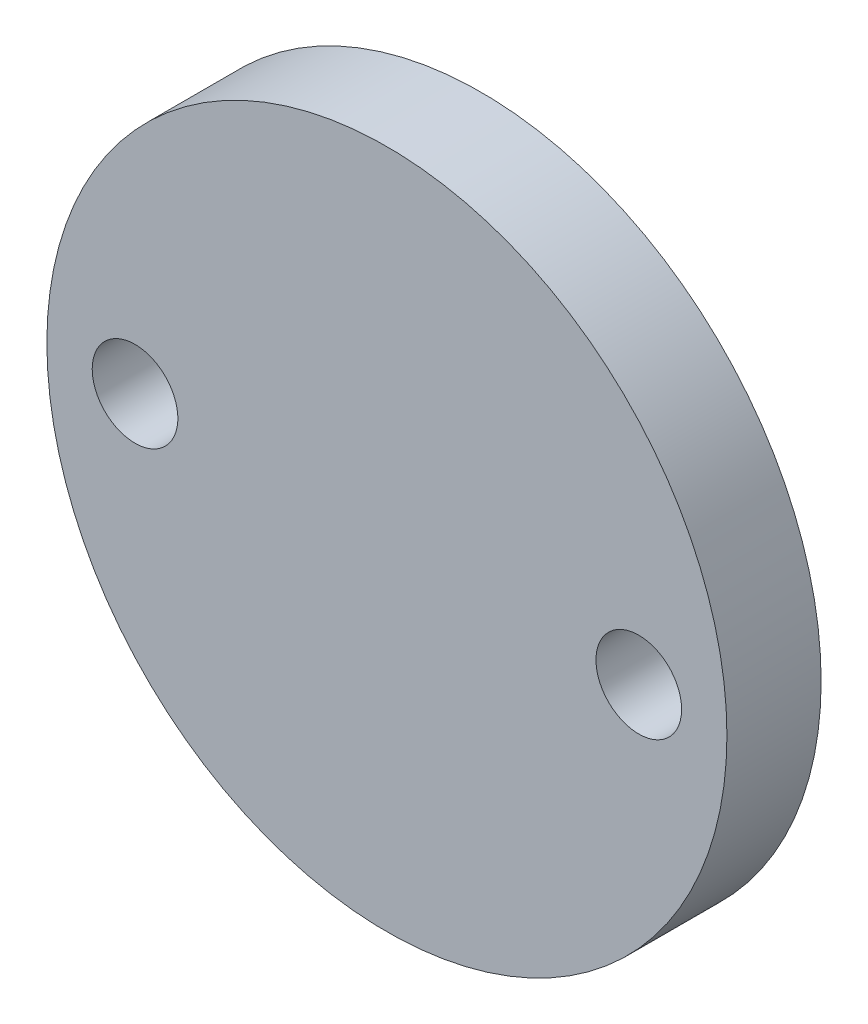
from build123d import *

# Parameters (mm, degrees)
SKETCH1_R          = 17.145
BASE_EXTRUDE_DEPTH = 4.7498
SKETCH2_R          = 2.159
CUT_EXTRUDE1_DEPTH = 25.707542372


with BuildPart() as part:
    # Sketch1 → Base-Extrude (new body)
    with BuildSketch(Plane.XY):
        Circle(SKETCH1_R)
    extrude(amount=BASE_EXTRUDE_DEPTH)

    # Sketch2 → Cut-Extrude1 (cut, through all)
    with BuildSketch(Plane.XY.offset(4.7498)):
        with Locations((12.7, 0)):
            Circle(SKETCH2_R)
        with Locations(Location((-12.7, 0, 0), (0, 0, 180))):
            Circle(SKETCH2_R)
    extrude(amount=-CUT_EXTRUDE1_DEPTH, mode=Mode.SUBTRACT)


solid = part.part
